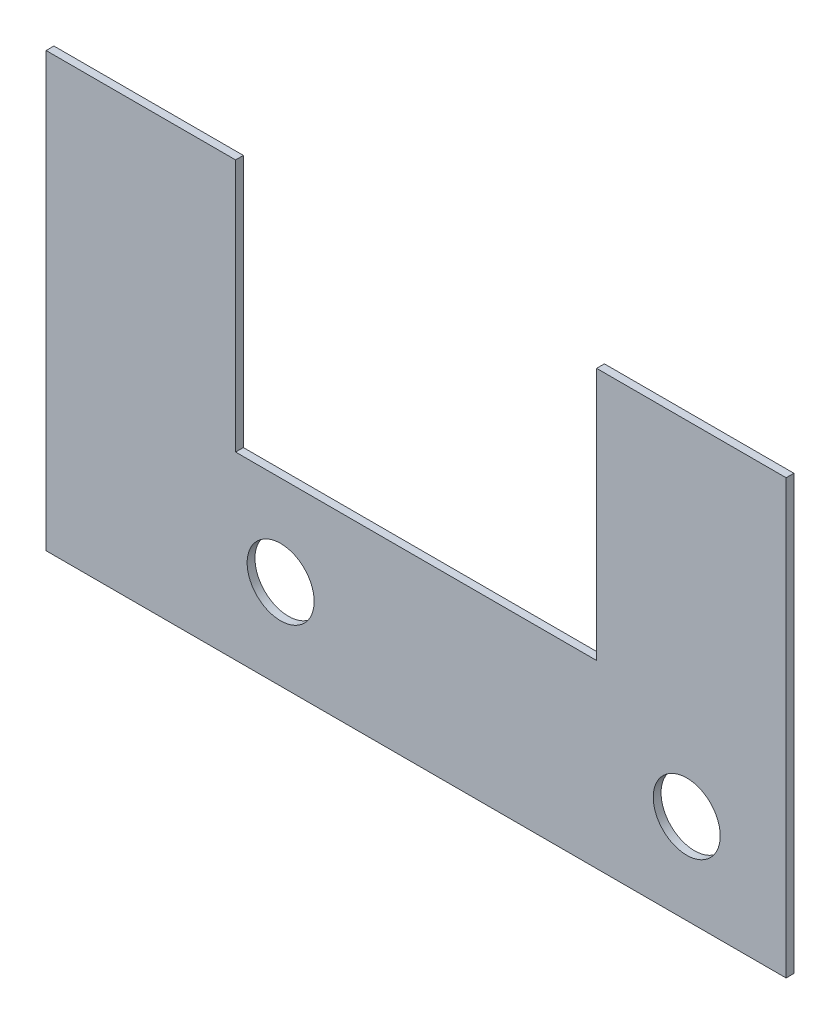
ISO-10303-21;
HEADER;
FILE_DESCRIPTION(('STEP AP214'),'2;1');
FILE_NAME('part.step','',(''),(''),'','','');
FILE_SCHEMA(('AUTOMOTIVE_DESIGN { 1 0 10303 214 1 1 1 1 }'));
ENDSEC;
DATA;
#1=APPLICATION_CONTEXT('core data for automotive mechanical design processes');
#2=APPLICATION_PROTOCOL_DEFINITION('international standard','automotive_design',2000,#1);
#3=PRODUCT_CONTEXT('',#1,'mechanical');
#4=PRODUCT('Part','Part','',(#3));
#5=PRODUCT_RELATED_PRODUCT_CATEGORY('part','',(#4));
#6=PRODUCT_DEFINITION_FORMATION('','',#4);
#7=PRODUCT_DEFINITION_CONTEXT('part definition',#1,'design');
#8=PRODUCT_DEFINITION('design','',#6,#7);
#9=PRODUCT_DEFINITION_SHAPE('','',#8);
#10=(LENGTH_UNIT() NAMED_UNIT(*) SI_UNIT(.MILLI.,.METRE.));
#11=(NAMED_UNIT(*) PLANE_ANGLE_UNIT() SI_UNIT($,.RADIAN.));
#12=(NAMED_UNIT(*) SI_UNIT($,.STERADIAN.) SOLID_ANGLE_UNIT());
#13=UNCERTAINTY_MEASURE_WITH_UNIT(LENGTH_MEASURE(1.E-05),#10,'distance_accuracy_value','');
#14=(GEOMETRIC_REPRESENTATION_CONTEXT(3) GLOBAL_UNCERTAINTY_ASSIGNED_CONTEXT((#13)) GLOBAL_UNIT_ASSIGNED_CONTEXT((#10,
#11,#12)) REPRESENTATION_CONTEXT('',''));
#15=CARTESIAN_POINT('',(0.,0.,0.));
#16=DIRECTION('',(0.,0.,1.));
#17=DIRECTION('',(1.,0.,0.));
#18=AXIS2_PLACEMENT_3D('',#15,#16,#17);
#19=CARTESIAN_POINT('',(-16.2687,19.05,0.3429));
#20=DIRECTION('',(0.,-1.,0.));
#21=DIRECTION('',(0.,0.,-1.));
#22=AXIS2_PLACEMENT_3D('',#19,#20,#21);
#23=PLANE('',#22);
#24=DIRECTION('',(-1.,0.,0.));
#25=VECTOR('',#24,1.);
#26=CARTESIAN_POINT('',(-16.2687,19.05,0.3429));
#27=LINE('',#26,#25);
#28=CARTESIAN_POINT('',(-7.9375,19.05,0.3429));
#29=VERTEX_POINT('',#28);
#30=CARTESIAN_POINT('',(-16.2687,19.05,0.3429));
#31=VERTEX_POINT('',#30);
#32=EDGE_CURVE('E57',#29,#31,#27,.T.);
#33=ORIENTED_EDGE('',*,*,#32,.F.);
#34=DIRECTION('',(0.,0.,1.));
#35=VECTOR('',#34,1.);
#36=CARTESIAN_POINT('',(-7.9375,19.05,0.));
#37=LINE('',#36,#35);
#38=CARTESIAN_POINT('',(-7.9375,19.05,0.));
#39=VERTEX_POINT('',#38);
#40=EDGE_CURVE('E136',#39,#29,#37,.T.);
#41=ORIENTED_EDGE('',*,*,#40,.F.);
#42=DIRECTION('',(-1.,0.,0.));
#43=VECTOR('',#42,1.);
#44=CARTESIAN_POINT('',(-16.2687,19.05,0.));
#45=LINE('',#44,#43);
#46=CARTESIAN_POINT('',(-16.2687,19.05,0.));
#47=VERTEX_POINT('',#46);
#48=EDGE_CURVE('E79',#39,#47,#45,.T.);
#49=ORIENTED_EDGE('',*,*,#48,.T.);
#50=DIRECTION('',(0.,0.,-1.));
#51=VECTOR('',#50,1.);
#52=CARTESIAN_POINT('',(-16.2687,19.05,0.3429));
#53=LINE('',#52,#51);
#54=EDGE_CURVE('E152',#31,#47,#53,.T.);
#55=ORIENTED_EDGE('',*,*,#54,.F.);
#56=EDGE_LOOP('',(#33,#41,#49,#55));
#57=FACE_BOUND('',#56,.T.);
#58=ADVANCED_FACE('F33',(#57),#23,.F.);
#59=CARTESIAN_POINT('',(-16.2687,19.05,0.3429));
#60=DIRECTION('',(1.,0.,0.));
#61=DIRECTION('',(0.,0.,-1.));
#62=AXIS2_PLACEMENT_3D('',#59,#60,#61);
#63=PLANE('',#62);
#64=DIRECTION('',(0.,-1.,0.));
#65=VECTOR('',#64,1.);
#66=CARTESIAN_POINT('',(-16.2687,19.05,0.));
#67=LINE('',#66,#65);
#68=CARTESIAN_POINT('',(-16.2687,0.,0.));
#69=VERTEX_POINT('',#68);
#70=EDGE_CURVE('E138',#47,#69,#67,.T.);
#71=ORIENTED_EDGE('',*,*,#70,.T.);
#72=DIRECTION('',(0.,0.,-1.));
#73=VECTOR('',#72,1.);
#74=CARTESIAN_POINT('',(-16.2687,0.,0.3429));
#75=LINE('',#74,#73);
#76=CARTESIAN_POINT('',(-16.2687,0.,0.3429));
#77=VERTEX_POINT('',#76);
#78=EDGE_CURVE('E11',#77,#69,#75,.T.);
#79=ORIENTED_EDGE('',*,*,#78,.F.);
#80=DIRECTION('',(0.,-1.,0.));
#81=VECTOR('',#80,1.);
#82=CARTESIAN_POINT('',(-16.2687,19.05,0.3429));
#83=LINE('',#82,#81);
#84=EDGE_CURVE('E143',#31,#77,#83,.T.);
#85=ORIENTED_EDGE('',*,*,#84,.F.);
#86=ORIENTED_EDGE('',*,*,#54,.T.);
#87=EDGE_LOOP('',(#71,#79,#85,#86));
#88=FACE_BOUND('',#87,.T.);
#89=ADVANCED_FACE('F35',(#88),#63,.F.);
#90=CARTESIAN_POINT('',(-16.2687,0.,0.3429));
#91=DIRECTION('',(0.,1.,0.));
#92=DIRECTION('',(0.,0.,1.));
#93=AXIS2_PLACEMENT_3D('',#90,#91,#92);
#94=PLANE('',#93);
#95=DIRECTION('',(1.,0.,0.));
#96=VECTOR('',#95,1.);
#97=CARTESIAN_POINT('',(-16.2687,0.,0.));
#98=LINE('',#97,#96);
#99=CARTESIAN_POINT('',(16.2687,0.,0.));
#100=VERTEX_POINT('',#99);
#101=EDGE_CURVE('E155',#69,#100,#98,.T.);
#102=ORIENTED_EDGE('',*,*,#101,.T.);
#103=DIRECTION('',(0.,0.,-1.));
#104=VECTOR('',#103,1.);
#105=CARTESIAN_POINT('',(16.2687,0.,0.3429));
#106=LINE('',#105,#104);
#107=CARTESIAN_POINT('',(16.2687,0.,0.3429));
#108=VERTEX_POINT('',#107);
#109=EDGE_CURVE('E41',#108,#100,#106,.T.);
#110=ORIENTED_EDGE('',*,*,#109,.F.);
#111=DIRECTION('',(1.,0.,0.));
#112=VECTOR('',#111,1.);
#113=CARTESIAN_POINT('',(-16.2687,0.,0.3429));
#114=LINE('',#113,#112);
#115=EDGE_CURVE('E86',#77,#108,#114,.T.);
#116=ORIENTED_EDGE('',*,*,#115,.F.);
#117=ORIENTED_EDGE('',*,*,#78,.T.);
#118=EDGE_LOOP('',(#102,#110,#116,#117));
#119=FACE_BOUND('',#118,.T.);
#120=ADVANCED_FACE('F179',(#119),#94,.F.);
#121=CARTESIAN_POINT('',(16.2687,19.05,0.3429));
#122=DIRECTION('',(-1.,0.,0.));
#123=DIRECTION('',(0.,0.,1.));
#124=AXIS2_PLACEMENT_3D('',#121,#122,#123);
#125=PLANE('',#124);
#126=DIRECTION('',(0.,1.,0.));
#127=VECTOR('',#126,1.);
#128=CARTESIAN_POINT('',(16.2687,19.05,0.));
#129=LINE('',#128,#127);
#130=CARTESIAN_POINT('',(16.2687,19.05,0.));
#131=VERTEX_POINT('',#130);
#132=EDGE_CURVE('E157',#100,#131,#129,.T.);
#133=ORIENTED_EDGE('',*,*,#132,.T.);
#134=DIRECTION('',(0.,0.,-1.));
#135=VECTOR('',#134,1.);
#136=CARTESIAN_POINT('',(16.2687,19.05,0.3429));
#137=LINE('',#136,#135);
#138=CARTESIAN_POINT('',(16.2687,19.05,0.3429));
#139=VERTEX_POINT('',#138);
#140=EDGE_CURVE('E162',#139,#131,#137,.T.);
#141=ORIENTED_EDGE('',*,*,#140,.F.);
#142=DIRECTION('',(0.,1.,0.));
#143=VECTOR('',#142,1.);
#144=CARTESIAN_POINT('',(16.2687,19.05,0.3429));
#145=LINE('',#144,#143);
#146=EDGE_CURVE('E147',#108,#139,#145,.T.);
#147=ORIENTED_EDGE('',*,*,#146,.F.);
#148=ORIENTED_EDGE('',*,*,#109,.T.);
#149=EDGE_LOOP('',(#133,#141,#147,#148));
#150=FACE_BOUND('',#149,.T.);
#151=ADVANCED_FACE('F168',(#150),#125,.F.);
#152=CARTESIAN_POINT('',(7.9375,19.05,0.));
#153=VERTEX_POINT('',#152);
#154=EDGE_CURVE('E145',#131,#153,#45,.T.);
#155=ORIENTED_EDGE('',*,*,#154,.T.);
#156=DIRECTION('',(0.,0.,1.));
#157=VECTOR('',#156,1.);
#158=CARTESIAN_POINT('',(7.9375,19.05,0.));
#159=LINE('',#158,#157);
#160=CARTESIAN_POINT('',(7.9375,19.05,0.3429));
#161=VERTEX_POINT('',#160);
#162=EDGE_CURVE('E139',#153,#161,#159,.T.);
#163=ORIENTED_EDGE('',*,*,#162,.T.);
#164=EDGE_CURVE('E149',#139,#161,#27,.T.);
#165=ORIENTED_EDGE('',*,*,#164,.F.);
#166=ORIENTED_EDGE('',*,*,#140,.T.);
#167=EDGE_LOOP('',(#155,#163,#165,#166));
#168=FACE_BOUND('',#167,.T.);
#169=ADVANCED_FACE('F172',(#168),#23,.F.);
#170=CARTESIAN_POINT('',(-16.2687,0.,0.3429));
#171=DIRECTION('',(0.,0.,1.));
#172=DIRECTION('',(1.,0.,0.));
#173=AXIS2_PLACEMENT_3D('',#170,#171,#172);
#174=PLANE('',#173);
#175=CARTESIAN_POINT('',(11.8999,3.9624,0.3429));
#176=DIRECTION('',(0.,0.,1.));
#177=DIRECTION('',(1.,0.,0.));
#178=AXIS2_PLACEMENT_3D('',#175,#176,#177);
#179=CIRCLE('',#178,1.4732);
#180=CARTESIAN_POINT('',(13.3731,3.9624,0.3429));
#181=VERTEX_POINT('',#180);
#182=EDGE_CURVE('E222',#181,#181,#179,.T.);
#183=ORIENTED_EDGE('',*,*,#182,.F.);
#184=EDGE_LOOP('',(#183));
#185=FACE_BOUND('',#184,.T.);
#186=CARTESIAN_POINT('',(-5.9563,3.9624,0.3429));
#187=DIRECTION('',(0.,0.,1.));
#188=DIRECTION('',(1.,0.,0.));
#189=AXIS2_PLACEMENT_3D('',#186,#187,#188);
#190=CIRCLE('',#189,1.4732);
#191=CARTESIAN_POINT('',(-4.4831,3.9624,0.3429));
#192=VERTEX_POINT('',#191);
#193=EDGE_CURVE('E226',#192,#192,#190,.T.);
#194=ORIENTED_EDGE('',*,*,#193,.F.);
#195=EDGE_LOOP('',(#194));
#196=FACE_BOUND('',#195,.T.);
#197=DIRECTION('',(0.,-1.,0.));
#198=VECTOR('',#197,1.);
#199=CARTESIAN_POINT('',(-7.9375,19.05,0.3429));
#200=LINE('',#199,#198);
#201=CARTESIAN_POINT('',(-7.93749999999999,7.9248,0.3429));
#202=VERTEX_POINT('',#201);
#203=EDGE_CURVE('E112',#29,#202,#200,.T.);
#204=ORIENTED_EDGE('',*,*,#203,.F.);
#205=ORIENTED_EDGE('',*,*,#32,.T.);
#206=ORIENTED_EDGE('',*,*,#84,.T.);
#207=ORIENTED_EDGE('',*,*,#115,.T.);
#208=ORIENTED_EDGE('',*,*,#146,.T.);
#209=ORIENTED_EDGE('',*,*,#164,.T.);
#210=DIRECTION('',(0.,1.,0.));
#211=VECTOR('',#210,1.);
#212=CARTESIAN_POINT('',(7.9375,19.05,0.3429));
#213=LINE('',#212,#211);
#214=CARTESIAN_POINT('',(7.93749999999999,7.9248,0.3429));
#215=VERTEX_POINT('',#214);
#216=EDGE_CURVE('E125',#215,#161,#213,.T.);
#217=ORIENTED_EDGE('',*,*,#216,.F.);
#218=DIRECTION('',(1.,0.,0.));
#219=VECTOR('',#218,1.);
#220=CARTESIAN_POINT('',(-7.93749999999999,7.9248,0.3429));
#221=LINE('',#220,#219);
#222=EDGE_CURVE('E127',#202,#215,#221,.T.);
#223=ORIENTED_EDGE('',*,*,#222,.F.);
#224=EDGE_LOOP('',(#204,#205,#206,#207,#208,#209,#217,#223));
#225=FACE_BOUND('',#224,.T.);
#226=ADVANCED_FACE('F175',(#185,#196,#225),#174,.T.);
#227=CARTESIAN_POINT('',(-16.2687,0.,0.));
#228=DIRECTION('',(0.,0.,1.));
#229=DIRECTION('',(1.,0.,0.));
#230=AXIS2_PLACEMENT_3D('',#227,#228,#229);
#231=PLANE('',#230);
#232=CARTESIAN_POINT('',(11.8999,3.9624,0.));
#233=DIRECTION('',(0.,0.,1.));
#234=DIRECTION('',(1.,0.,0.));
#235=AXIS2_PLACEMENT_3D('',#232,#233,#234);
#236=CIRCLE('',#235,1.4732);
#237=CARTESIAN_POINT('',(13.3731,3.9624,0.));
#238=VERTEX_POINT('',#237);
#239=EDGE_CURVE('E225',#238,#238,#236,.F.);
#240=ORIENTED_EDGE('',*,*,#239,.F.);
#241=EDGE_LOOP('',(#240));
#242=FACE_BOUND('',#241,.T.);
#243=CARTESIAN_POINT('',(-5.9563,3.9624,0.));
#244=DIRECTION('',(0.,0.,1.));
#245=DIRECTION('',(1.,0.,0.));
#246=AXIS2_PLACEMENT_3D('',#243,#244,#245);
#247=CIRCLE('',#246,1.4732);
#248=CARTESIAN_POINT('',(-4.4831,3.9624,0.));
#249=VERTEX_POINT('',#248);
#250=EDGE_CURVE('E130',#249,#249,#247,.F.);
#251=ORIENTED_EDGE('',*,*,#250,.F.);
#252=EDGE_LOOP('',(#251));
#253=FACE_BOUND('',#252,.T.);
#254=ORIENTED_EDGE('',*,*,#48,.F.);
#255=DIRECTION('',(0.,-1.,0.));
#256=VECTOR('',#255,1.);
#257=CARTESIAN_POINT('',(-7.9375,19.05,0.));
#258=LINE('',#257,#256);
#259=CARTESIAN_POINT('',(-7.93749999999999,7.9248,0.));
#260=VERTEX_POINT('',#259);
#261=EDGE_CURVE('E111',#39,#260,#258,.T.);
#262=ORIENTED_EDGE('',*,*,#261,.T.);
#263=DIRECTION('',(1.,0.,0.));
#264=VECTOR('',#263,1.);
#265=CARTESIAN_POINT('',(-7.93749999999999,7.9248,0.));
#266=LINE('',#265,#264);
#267=CARTESIAN_POINT('',(7.93749999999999,7.9248,0.));
#268=VERTEX_POINT('',#267);
#269=EDGE_CURVE('E119',#260,#268,#266,.T.);
#270=ORIENTED_EDGE('',*,*,#269,.T.);
#271=DIRECTION('',(0.,1.,0.));
#272=VECTOR('',#271,1.);
#273=CARTESIAN_POINT('',(7.9375,19.05,0.));
#274=LINE('',#273,#272);
#275=EDGE_CURVE('E48',#268,#153,#274,.T.);
#276=ORIENTED_EDGE('',*,*,#275,.T.);
#277=ORIENTED_EDGE('',*,*,#154,.F.);
#278=ORIENTED_EDGE('',*,*,#132,.F.);
#279=ORIENTED_EDGE('',*,*,#101,.F.);
#280=ORIENTED_EDGE('',*,*,#70,.F.);
#281=EDGE_LOOP('',(#254,#262,#270,#276,#277,#278,#279,#280));
#282=FACE_BOUND('',#281,.T.);
#283=ADVANCED_FACE('F123',(#242,#253,#282),#231,.F.);
#284=CARTESIAN_POINT('',(-7.9375,19.05,0.));
#285=DIRECTION('',(-1.,0.,0.));
#286=DIRECTION('',(0.,-1.,0.));
#287=AXIS2_PLACEMENT_3D('',#284,#285,#286);
#288=PLANE('',#287);
#289=ORIENTED_EDGE('',*,*,#203,.T.);
#290=DIRECTION('',(0.,0.,1.));
#291=VECTOR('',#290,1.);
#292=CARTESIAN_POINT('',(-7.93749999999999,7.9248,0.));
#293=LINE('',#292,#291);
#294=EDGE_CURVE('E107',#260,#202,#293,.T.);
#295=ORIENTED_EDGE('',*,*,#294,.F.);
#296=ORIENTED_EDGE('',*,*,#261,.F.);
#297=ORIENTED_EDGE('',*,*,#40,.T.);
#298=EDGE_LOOP('',(#289,#295,#296,#297));
#299=FACE_BOUND('',#298,.T.);
#300=ADVANCED_FACE('F109',(#299),#288,.F.);
#301=CARTESIAN_POINT('',(7.9375,19.05,0.));
#302=DIRECTION('',(1.,0.,0.));
#303=DIRECTION('',(0.,1.,0.));
#304=AXIS2_PLACEMENT_3D('',#301,#302,#303);
#305=PLANE('',#304);
#306=ORIENTED_EDGE('',*,*,#216,.T.);
#307=ORIENTED_EDGE('',*,*,#162,.F.);
#308=ORIENTED_EDGE('',*,*,#275,.F.);
#309=DIRECTION('',(0.,0.,1.));
#310=VECTOR('',#309,1.);
#311=CARTESIAN_POINT('',(7.93749999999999,7.9248,0.));
#312=LINE('',#311,#310);
#313=EDGE_CURVE('E116',#268,#215,#312,.T.);
#314=ORIENTED_EDGE('',*,*,#313,.T.);
#315=EDGE_LOOP('',(#306,#307,#308,#314));
#316=FACE_BOUND('',#315,.T.);
#317=ADVANCED_FACE('F206',(#316),#305,.F.);
#318=CARTESIAN_POINT('',(-7.93749999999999,7.9248,0.));
#319=DIRECTION('',(0.,-1.,0.));
#320=DIRECTION('',(0.,0.,-1.));
#321=AXIS2_PLACEMENT_3D('',#318,#319,#320);
#322=PLANE('',#321);
#323=ORIENTED_EDGE('',*,*,#222,.T.);
#324=ORIENTED_EDGE('',*,*,#313,.F.);
#325=ORIENTED_EDGE('',*,*,#269,.F.);
#326=ORIENTED_EDGE('',*,*,#294,.T.);
#327=EDGE_LOOP('',(#323,#324,#325,#326));
#328=FACE_BOUND('',#327,.T.);
#329=ADVANCED_FACE('F120',(#328),#322,.F.);
#330=CARTESIAN_POINT('',(-5.9563,3.9624,-0.00100000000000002));
#331=DIRECTION('',(0.,0.,1.));
#332=DIRECTION('',(1.,0.,0.));
#333=AXIS2_PLACEMENT_3D('',#330,#331,#332);
#334=CYLINDRICAL_SURFACE('',#333,1.4732);
#335=ORIENTED_EDGE('',*,*,#193,.T.);
#336=EDGE_LOOP('',(#335));
#337=FACE_BOUND('',#336,.T.);
#338=ORIENTED_EDGE('',*,*,#250,.T.);
#339=EDGE_LOOP('',(#338));
#340=FACE_BOUND('',#339,.T.);
#341=ADVANCED_FACE('F209',(#337,#340),#334,.F.);
#342=CARTESIAN_POINT('',(11.8999,3.9624,-0.00100000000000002));
#343=DIRECTION('',(0.,0.,1.));
#344=DIRECTION('',(1.,0.,0.));
#345=AXIS2_PLACEMENT_3D('',#342,#343,#344);
#346=CYLINDRICAL_SURFACE('',#345,1.4732);
#347=ORIENTED_EDGE('',*,*,#182,.T.);
#348=EDGE_LOOP('',(#347));
#349=FACE_BOUND('',#348,.T.);
#350=ORIENTED_EDGE('',*,*,#239,.T.);
#351=EDGE_LOOP('',(#350));
#352=FACE_BOUND('',#351,.T.);
#353=ADVANCED_FACE('F214',(#349,#352),#346,.F.);
#354=CLOSED_SHELL('',(#58,#89,#120,#151,#169,#226,#283,#300,#317,#329,#341,#353));
#355=MANIFOLD_SOLID_BREP('B2',#354);
#356=ADVANCED_BREP_SHAPE_REPRESENTATION('',(#18,#355),#14);
#357=SHAPE_DEFINITION_REPRESENTATION(#9,#356);
ENDSEC;
END-ISO-10303-21;
